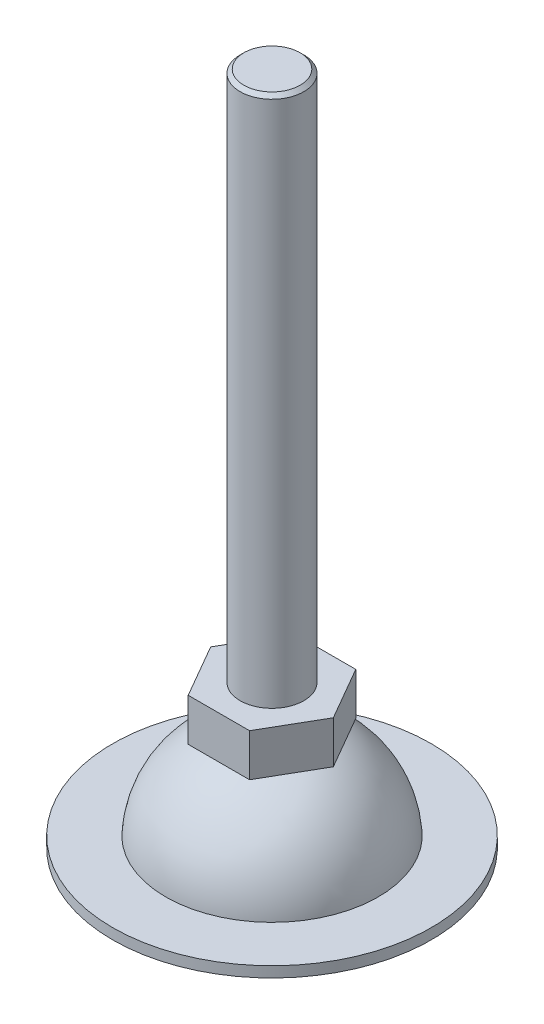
ISO-10303-21;
HEADER;
FILE_DESCRIPTION(('STEP AP214'),'2;1');
FILE_NAME('part.step','',(''),(''),'','','');
FILE_SCHEMA(('AUTOMOTIVE_DESIGN { 1 0 10303 214 1 1 1 1 }'));
ENDSEC;
DATA;
#1=APPLICATION_CONTEXT('core data for automotive mechanical design processes');
#2=APPLICATION_PROTOCOL_DEFINITION('international standard','automotive_design',2000,#1);
#3=PRODUCT_CONTEXT('',#1,'mechanical');
#4=PRODUCT('Part','Part','',(#3));
#5=PRODUCT_RELATED_PRODUCT_CATEGORY('part','',(#4));
#6=PRODUCT_DEFINITION_FORMATION('','',#4);
#7=PRODUCT_DEFINITION_CONTEXT('part definition',#1,'design');
#8=PRODUCT_DEFINITION('design','',#6,#7);
#9=PRODUCT_DEFINITION_SHAPE('','',#8);
#10=(LENGTH_UNIT() NAMED_UNIT(*) SI_UNIT(.MILLI.,.METRE.));
#11=(NAMED_UNIT(*) PLANE_ANGLE_UNIT() SI_UNIT($,.RADIAN.));
#12=(NAMED_UNIT(*) SI_UNIT($,.STERADIAN.) SOLID_ANGLE_UNIT());
#13=UNCERTAINTY_MEASURE_WITH_UNIT(LENGTH_MEASURE(1.E-05),#10,'distance_accuracy_value','');
#14=(GEOMETRIC_REPRESENTATION_CONTEXT(3) GLOBAL_UNCERTAINTY_ASSIGNED_CONTEXT((#13)) GLOBAL_UNIT_ASSIGNED_CONTEXT((#10,
#11,#12)) REPRESENTATION_CONTEXT('',''));
#15=CARTESIAN_POINT('',(0.,0.,0.));
#16=DIRECTION('',(0.,0.,1.));
#17=DIRECTION('',(1.,0.,0.));
#18=AXIS2_PLACEMENT_3D('',#15,#16,#17);
#19=CARTESIAN_POINT('',(0.,127.,1.11022302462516E-13));
#20=DIRECTION('',(0.,1.,0.));
#21=DIRECTION('',(0.,0.,1.));
#22=AXIS2_PLACEMENT_3D('',#19,#20,#21);
#23=CYLINDRICAL_SURFACE('',#22,29.9999999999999);
#24=CARTESIAN_POINT('',(0.,0.,0.));
#25=DIRECTION('',(0.,1.,0.));
#26=DIRECTION('',(0.,0.,1.));
#27=AXIS2_PLACEMENT_3D('',#24,#25,#26);
#28=CIRCLE('',#27,29.9999999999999);
#29=CARTESIAN_POINT('',(0.,0.,29.9999999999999));
#30=VERTEX_POINT('',#29);
#31=EDGE_CURVE('E44',#30,#30,#28,.T.);
#32=ORIENTED_EDGE('',*,*,#31,.T.);
#33=EDGE_LOOP('',(#32));
#34=FACE_BOUND('',#33,.T.);
#35=CARTESIAN_POINT('',(0.,2.00000000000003,0.));
#36=DIRECTION('',(0.,1.,0.));
#37=DIRECTION('',(0.,0.,1.));
#38=AXIS2_PLACEMENT_3D('',#35,#36,#37);
#39=CIRCLE('',#38,29.9999999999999);
#40=CARTESIAN_POINT('',(0.,2.,29.9999999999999));
#41=VERTEX_POINT('',#40);
#42=EDGE_CURVE('E145',#41,#41,#39,.T.);
#43=ORIENTED_EDGE('',*,*,#42,.F.);
#44=EDGE_LOOP('',(#43));
#45=FACE_BOUND('',#44,.T.);
#46=ADVANCED_FACE('F35',(#34,#45),#23,.T.);
#47=CARTESIAN_POINT('',(0.,0.,29.9999999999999));
#48=DIRECTION('',(0.,-1.,0.));
#49=DIRECTION('',(0.,0.,-1.));
#50=AXIS2_PLACEMENT_3D('',#47,#48,#49);
#51=PLANE('',#50);
#52=ORIENTED_EDGE('',*,*,#31,.F.);
#53=EDGE_LOOP('',(#52));
#54=FACE_BOUND('',#53,.T.);
#55=ADVANCED_FACE('F162',(#54),#51,.T.);
#56=CARTESIAN_POINT('',(0.,0.92866239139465,0.));
#57=DIRECTION('',(0.,1.,0.));
#58=DIRECTION('',(0.,0.,1.));
#59=AXIS2_PLACEMENT_3D('',#56,#57,#58);
#60=DEGENERATE_TOROIDAL_SURFACE('',#59,0.896647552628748,19.1333697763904,.T.);
#61=CARTESIAN_POINT('',(0.,19.,0.));
#62=DIRECTION('',(0.,-1.,0.));
#63=DIRECTION('',(0.,0.,-1.));
#64=AXIS2_PLACEMENT_3D('',#61,#62,#63);
#65=CIRCLE('',#64,7.18255210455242);
#66=CARTESIAN_POINT('',(0.,19.,-7.18255210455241));
#67=VERTEX_POINT('',#66);
#68=EDGE_CURVE('E11',#67,#67,#65,.F.);
#69=ORIENTED_EDGE('',*,*,#68,.F.);
#70=EDGE_LOOP('',(#69));
#71=FACE_BOUND('',#70,.T.);
#72=CARTESIAN_POINT('',(0.,2.00000000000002,0.));
#73=DIRECTION('',(0.,1.,0.));
#74=DIRECTION('',(0.,0.,1.));
#75=AXIS2_PLACEMENT_3D('',#72,#73,#74);
#76=CIRCLE('',#75,19.9999999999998);
#77=CARTESIAN_POINT('',(0.,2.,19.9999999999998));
#78=VERTEX_POINT('',#77);
#79=EDGE_CURVE('E148',#78,#78,#76,.T.);
#80=ORIENTED_EDGE('',*,*,#79,.T.);
#81=EDGE_LOOP('',(#80));
#82=FACE_BOUND('',#81,.T.);
#83=ADVANCED_FACE('F164',(#71,#82),#60,.T.);
#84=CARTESIAN_POINT('',(0.,2.,29.9999999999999));
#85=DIRECTION('',(0.,1.,0.));
#86=DIRECTION('',(0.,0.,1.));
#87=AXIS2_PLACEMENT_3D('',#84,#85,#86);
#88=PLANE('',#87);
#89=ORIENTED_EDGE('',*,*,#42,.T.);
#90=EDGE_LOOP('',(#89));
#91=FACE_BOUND('',#90,.T.);
#92=ORIENTED_EDGE('',*,*,#79,.F.);
#93=EDGE_LOOP('',(#92));
#94=FACE_BOUND('',#93,.T.);
#95=ADVANCED_FACE('F169',(#91,#94),#88,.T.);
#96=CARTESIAN_POINT('',(5.77350269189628,27.,-10.0000000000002));
#97=DIRECTION('',(0.866025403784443,0.,-0.499999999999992));
#98=DIRECTION('',(-0.499999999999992,0.,-0.866025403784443));
#99=AXIS2_PLACEMENT_3D('',#96,#97,#98);
#100=PLANE('',#99);
#101=DIRECTION('',(0.499999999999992,0.,0.866025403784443));
#102=VECTOR('',#101,1.);
#103=CARTESIAN_POINT('',(5.77350269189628,19.,-10.0000000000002));
#104=LINE('',#103,#102);
#105=CARTESIAN_POINT('',(5.77350269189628,19.,-10.0000000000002));
#106=VERTEX_POINT('',#105);
#107=CARTESIAN_POINT('',(11.5470053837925,19.,0.));
#108=VERTEX_POINT('',#107);
#109=EDGE_CURVE('E123',#106,#108,#104,.T.);
#110=ORIENTED_EDGE('',*,*,#109,.F.);
#111=DIRECTION('',(0.,-1.,0.));
#112=VECTOR('',#111,1.);
#113=CARTESIAN_POINT('',(5.77350269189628,27.,-10.0000000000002));
#114=LINE('',#113,#112);
#115=CARTESIAN_POINT('',(5.77350269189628,27.,-10.0000000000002));
#116=VERTEX_POINT('',#115);
#117=EDGE_CURVE('E52',#116,#106,#114,.T.);
#118=ORIENTED_EDGE('',*,*,#117,.F.);
#119=DIRECTION('',(0.499999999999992,0.,0.866025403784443));
#120=VECTOR('',#119,1.);
#121=CARTESIAN_POINT('',(5.77350269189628,27.,-10.0000000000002));
#122=LINE('',#121,#120);
#123=CARTESIAN_POINT('',(11.5470053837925,27.,0.));
#124=VERTEX_POINT('',#123);
#125=EDGE_CURVE('E138',#116,#124,#122,.T.);
#126=ORIENTED_EDGE('',*,*,#125,.T.);
#127=DIRECTION('',(0.,-1.,0.));
#128=VECTOR('',#127,1.);
#129=CARTESIAN_POINT('',(11.5470053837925,27.,0.));
#130=LINE('',#129,#128);
#131=EDGE_CURVE('E87',#124,#108,#130,.T.);
#132=ORIENTED_EDGE('',*,*,#131,.T.);
#133=EDGE_LOOP('',(#110,#118,#126,#132));
#134=FACE_BOUND('',#133,.T.);
#135=ADVANCED_FACE('F188',(#134),#100,.T.);
#136=CARTESIAN_POINT('',(5.77350269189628,27.,-10.0000000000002));
#137=DIRECTION('',(0.,0.,-1.));
#138=DIRECTION('',(-1.,0.,0.));
#139=AXIS2_PLACEMENT_3D('',#136,#137,#138);
#140=PLANE('',#139);
#141=DIRECTION('',(1.,0.,0.));
#142=VECTOR('',#141,1.);
#143=CARTESIAN_POINT('',(5.77350269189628,19.,-10.0000000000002));
#144=LINE('',#143,#142);
#145=CARTESIAN_POINT('',(-5.77350269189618,19.,-10.0000000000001));
#146=VERTEX_POINT('',#145);
#147=EDGE_CURVE('E135',#146,#106,#144,.T.);
#148=ORIENTED_EDGE('',*,*,#147,.F.);
#149=DIRECTION('',(0.,-1.,0.));
#150=VECTOR('',#149,1.);
#151=CARTESIAN_POINT('',(-5.77350269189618,27.,-10.0000000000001));
#152=LINE('',#151,#150);
#153=CARTESIAN_POINT('',(-5.77350269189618,27.,-10.0000000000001));
#154=VERTEX_POINT('',#153);
#155=EDGE_CURVE('E75',#154,#146,#152,.T.);
#156=ORIENTED_EDGE('',*,*,#155,.F.);
#157=DIRECTION('',(1.,0.,0.));
#158=VECTOR('',#157,1.);
#159=CARTESIAN_POINT('',(5.77350269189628,27.,-10.0000000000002));
#160=LINE('',#159,#158);
#161=EDGE_CURVE('E113',#154,#116,#160,.T.);
#162=ORIENTED_EDGE('',*,*,#161,.T.);
#163=ORIENTED_EDGE('',*,*,#117,.T.);
#164=EDGE_LOOP('',(#148,#156,#162,#163));
#165=FACE_BOUND('',#164,.T.);
#166=ADVANCED_FACE('F192',(#165),#140,.T.);
#167=CARTESIAN_POINT('',(-5.77350269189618,27.,-10.0000000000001));
#168=DIRECTION('',(-0.866025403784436,0.,-0.500000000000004));
#169=DIRECTION('',(-0.500000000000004,0.,0.866025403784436));
#170=AXIS2_PLACEMENT_3D('',#167,#168,#169);
#171=PLANE('',#170);
#172=DIRECTION('',(0.500000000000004,0.,-0.866025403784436));
#173=VECTOR('',#172,1.);
#174=CARTESIAN_POINT('',(-5.77350269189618,19.,-10.0000000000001));
#175=LINE('',#174,#173);
#176=CARTESIAN_POINT('',(-11.5470053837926,19.,0.));
#177=VERTEX_POINT('',#176);
#178=EDGE_CURVE('E100',#177,#146,#175,.T.);
#179=ORIENTED_EDGE('',*,*,#178,.F.);
#180=DIRECTION('',(0.,-1.,0.));
#181=VECTOR('',#180,1.);
#182=CARTESIAN_POINT('',(-11.5470053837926,27.,0.));
#183=LINE('',#182,#181);
#184=CARTESIAN_POINT('',(-11.5470053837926,27.,0.));
#185=VERTEX_POINT('',#184);
#186=EDGE_CURVE('E95',#185,#177,#183,.T.);
#187=ORIENTED_EDGE('',*,*,#186,.F.);
#188=DIRECTION('',(0.500000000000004,0.,-0.866025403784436));
#189=VECTOR('',#188,1.);
#190=CARTESIAN_POINT('',(-5.77350269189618,27.,-10.0000000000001));
#191=LINE('',#190,#189);
#192=EDGE_CURVE('E98',#185,#154,#191,.T.);
#193=ORIENTED_EDGE('',*,*,#192,.T.);
#194=ORIENTED_EDGE('',*,*,#155,.T.);
#195=EDGE_LOOP('',(#179,#187,#193,#194));
#196=FACE_BOUND('',#195,.T.);
#197=ADVANCED_FACE('F97',(#196),#171,.T.);
#198=CARTESIAN_POINT('',(-11.5470053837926,27.,0.));
#199=DIRECTION('',(-0.866025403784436,0.,0.500000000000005));
#200=DIRECTION('',(0.500000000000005,0.,0.866025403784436));
#201=AXIS2_PLACEMENT_3D('',#198,#199,#200);
#202=PLANE('',#201);
#203=DIRECTION('',(-0.500000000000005,0.,-0.866025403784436));
#204=VECTOR('',#203,1.);
#205=CARTESIAN_POINT('',(-11.5470053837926,19.,0.));
#206=LINE('',#205,#204);
#207=CARTESIAN_POINT('',(-5.77350269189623,19.,10.));
#208=VERTEX_POINT('',#207);
#209=EDGE_CURVE('E132',#208,#177,#206,.T.);
#210=ORIENTED_EDGE('',*,*,#209,.F.);
#211=DIRECTION('',(0.,-1.,0.));
#212=VECTOR('',#211,1.);
#213=CARTESIAN_POINT('',(-5.77350269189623,27.,10.));
#214=LINE('',#213,#212);
#215=CARTESIAN_POINT('',(-5.77350269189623,27.,10.));
#216=VERTEX_POINT('',#215);
#217=EDGE_CURVE('E105',#216,#208,#214,.T.);
#218=ORIENTED_EDGE('',*,*,#217,.F.);
#219=DIRECTION('',(-0.500000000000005,0.,-0.866025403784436));
#220=VECTOR('',#219,1.);
#221=CARTESIAN_POINT('',(-11.5470053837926,27.,0.));
#222=LINE('',#221,#220);
#223=EDGE_CURVE('E111',#216,#185,#222,.T.);
#224=ORIENTED_EDGE('',*,*,#223,.T.);
#225=ORIENTED_EDGE('',*,*,#186,.T.);
#226=EDGE_LOOP('',(#210,#218,#224,#225));
#227=FACE_BOUND('',#226,.T.);
#228=ADVANCED_FACE('F115',(#227),#202,.T.);
#229=CARTESIAN_POINT('',(5.77350269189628,27.,10.));
#230=DIRECTION('',(0.,0.,1.));
#231=DIRECTION('',(0.,-1.,0.));
#232=AXIS2_PLACEMENT_3D('',#229,#230,#231);
#233=PLANE('',#232);
#234=DIRECTION('',(-1.,0.,0.));
#235=VECTOR('',#234,1.);
#236=CARTESIAN_POINT('',(5.77350269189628,19.,10.));
#237=LINE('',#236,#235);
#238=CARTESIAN_POINT('',(5.77350269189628,19.,10.));
#239=VERTEX_POINT('',#238);
#240=EDGE_CURVE('E129',#239,#208,#237,.T.);
#241=ORIENTED_EDGE('',*,*,#240,.F.);
#242=DIRECTION('',(0.,-1.,0.));
#243=VECTOR('',#242,1.);
#244=CARTESIAN_POINT('',(5.77350269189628,27.,10.));
#245=LINE('',#244,#243);
#246=CARTESIAN_POINT('',(5.77350269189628,27.,10.));
#247=VERTEX_POINT('',#246);
#248=EDGE_CURVE('E142',#247,#239,#245,.T.);
#249=ORIENTED_EDGE('',*,*,#248,.F.);
#250=DIRECTION('',(-1.,0.,0.));
#251=VECTOR('',#250,1.);
#252=CARTESIAN_POINT('',(5.77350269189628,27.,10.));
#253=LINE('',#252,#251);
#254=EDGE_CURVE('E116',#247,#216,#253,.T.);
#255=ORIENTED_EDGE('',*,*,#254,.T.);
#256=ORIENTED_EDGE('',*,*,#217,.T.);
#257=EDGE_LOOP('',(#241,#249,#255,#256));
#258=FACE_BOUND('',#257,.T.);
#259=ADVANCED_FACE('F196',(#258),#233,.T.);
#260=CARTESIAN_POINT('',(11.5470053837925,27.,0.));
#261=DIRECTION('',(0.866025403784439,0.,0.499999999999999));
#262=DIRECTION('',(0.499999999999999,0.,-0.866025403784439));
#263=AXIS2_PLACEMENT_3D('',#260,#261,#262);
#264=PLANE('',#263);
#265=DIRECTION('',(-0.499999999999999,0.,0.866025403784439));
#266=VECTOR('',#265,1.);
#267=CARTESIAN_POINT('',(11.5470053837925,19.,0.));
#268=LINE('',#267,#266);
#269=EDGE_CURVE('E126',#108,#239,#268,.T.);
#270=ORIENTED_EDGE('',*,*,#269,.F.);
#271=ORIENTED_EDGE('',*,*,#131,.F.);
#272=DIRECTION('',(-0.499999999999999,0.,0.866025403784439));
#273=VECTOR('',#272,1.);
#274=CARTESIAN_POINT('',(11.5470053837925,27.,0.));
#275=LINE('',#274,#273);
#276=EDGE_CURVE('E118',#124,#247,#275,.T.);
#277=ORIENTED_EDGE('',*,*,#276,.T.);
#278=ORIENTED_EDGE('',*,*,#248,.T.);
#279=EDGE_LOOP('',(#270,#271,#277,#278));
#280=FACE_BOUND('',#279,.T.);
#281=ADVANCED_FACE('F193',(#280),#264,.T.);
#282=CARTESIAN_POINT('',(5.77350269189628,27.,-10.0000000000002));
#283=DIRECTION('',(0.,-1.,0.));
#284=DIRECTION('',(0.,0.,-1.));
#285=AXIS2_PLACEMENT_3D('',#282,#283,#284);
#286=PLANE('',#285);
#287=CARTESIAN_POINT('',(0.,27.,0.));
#288=DIRECTION('',(0.,-1.,0.));
#289=DIRECTION('',(0.,0.,-1.));
#290=AXIS2_PLACEMENT_3D('',#287,#288,#289);
#291=CIRCLE('',#290,6.00000000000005);
#292=CARTESIAN_POINT('',(0.,27.,-6.00000000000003));
#293=VERTEX_POINT('',#292);
#294=EDGE_CURVE('E38',#293,#293,#291,.F.);
#295=ORIENTED_EDGE('',*,*,#294,.F.);
#296=EDGE_LOOP('',(#295));
#297=FACE_BOUND('',#296,.T.);
#298=ORIENTED_EDGE('',*,*,#125,.F.);
#299=ORIENTED_EDGE('',*,*,#161,.F.);
#300=ORIENTED_EDGE('',*,*,#192,.F.);
#301=ORIENTED_EDGE('',*,*,#223,.F.);
#302=ORIENTED_EDGE('',*,*,#254,.F.);
#303=ORIENTED_EDGE('',*,*,#276,.F.);
#304=EDGE_LOOP('',(#298,#299,#300,#301,#302,#303));
#305=FACE_BOUND('',#304,.T.);
#306=ADVANCED_FACE('F109',(#297,#305),#286,.F.);
#307=CARTESIAN_POINT('',(5.77350269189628,19.,-10.0000000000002));
#308=DIRECTION('',(0.,-1.,0.));
#309=DIRECTION('',(0.,0.,-1.));
#310=AXIS2_PLACEMENT_3D('',#307,#308,#309);
#311=PLANE('',#310);
#312=ORIENTED_EDGE('',*,*,#68,.T.);
#313=EDGE_LOOP('',(#312));
#314=FACE_BOUND('',#313,.T.);
#315=ORIENTED_EDGE('',*,*,#109,.T.);
#316=ORIENTED_EDGE('',*,*,#269,.T.);
#317=ORIENTED_EDGE('',*,*,#240,.T.);
#318=ORIENTED_EDGE('',*,*,#209,.T.);
#319=ORIENTED_EDGE('',*,*,#178,.T.);
#320=ORIENTED_EDGE('',*,*,#147,.T.);
#321=EDGE_LOOP('',(#315,#316,#317,#318,#319,#320));
#322=FACE_BOUND('',#321,.T.);
#323=ADVANCED_FACE('F177',(#314,#322),#311,.T.);
#324=CARTESIAN_POINT('',(0.,127.,5.30000000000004));
#325=DIRECTION('',(0.,1.,0.));
#326=DIRECTION('',(0.,0.,1.));
#327=AXIS2_PLACEMENT_3D('',#324,#325,#326);
#328=PLANE('',#327);
#329=CARTESIAN_POINT('',(0.,127.,1.11022302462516E-13));
#330=DIRECTION('',(0.,1.,0.));
#331=DIRECTION('',(0.,0.,1.));
#332=AXIS2_PLACEMENT_3D('',#329,#330,#331);
#333=CIRCLE('',#332,5.29999999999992);
#334=CARTESIAN_POINT('',(0.,127.,5.30000000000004));
#335=VERTEX_POINT('',#334);
#336=EDGE_CURVE('E154',#335,#335,#333,.T.);
#337=ORIENTED_EDGE('',*,*,#336,.T.);
#338=EDGE_LOOP('',(#337));
#339=FACE_BOUND('',#338,.T.);
#340=ADVANCED_FACE('F173',(#339),#328,.T.);
#341=CARTESIAN_POINT('',(0.,127.,1.11022302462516E-13));
#342=DIRECTION('',(0.,-1.,0.));
#343=DIRECTION('',(0.,0.,-1.));
#344=AXIS2_PLACEMENT_3D('',#341,#342,#343);
#345=CONICAL_SURFACE('',#344,5.29999999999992,0.785398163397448);
#346=CARTESIAN_POINT('',(0.,126.3,1.10410368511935E-13));
#347=DIRECTION('',(0.,1.,0.));
#348=DIRECTION('',(0.,0.,1.));
#349=AXIS2_PLACEMENT_3D('',#346,#347,#348);
#350=CIRCLE('',#349,6.00000000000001);
#351=CARTESIAN_POINT('',(0.,126.3,6.00000000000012));
#352=VERTEX_POINT('',#351);
#353=EDGE_CURVE('E151',#352,#352,#350,.T.);
#354=ORIENTED_EDGE('',*,*,#353,.T.);
#355=EDGE_LOOP('',(#354));
#356=FACE_BOUND('',#355,.T.);
#357=ORIENTED_EDGE('',*,*,#336,.F.);
#358=EDGE_LOOP('',(#357));
#359=FACE_BOUND('',#358,.T.);
#360=ADVANCED_FACE('F176',(#356,#359),#345,.T.);
#361=CARTESIAN_POINT('',(0.,127.,1.11022302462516E-13));
#362=DIRECTION('',(0.,1.,0.));
#363=DIRECTION('',(0.,0.,1.));
#364=AXIS2_PLACEMENT_3D('',#361,#362,#363);
#365=CYLINDRICAL_SURFACE('',#364,6.00000000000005);
#366=ORIENTED_EDGE('',*,*,#353,.F.);
#367=EDGE_LOOP('',(#366));
#368=FACE_BOUND('',#367,.T.);
#369=ORIENTED_EDGE('',*,*,#294,.T.);
#370=EDGE_LOOP('',(#369));
#371=FACE_BOUND('',#370,.T.);
#372=ADVANCED_FACE('F181',(#368,#371),#365,.T.);
#373=CLOSED_SHELL('',(#46,#55,#83,#95,#135,#166,#197,#228,#259,#281,#306,#323,#340,#360,#372));
#374=MANIFOLD_SOLID_BREP('B2',#373);
#375=ADVANCED_BREP_SHAPE_REPRESENTATION('',(#18,#374),#14);
#376=SHAPE_DEFINITION_REPRESENTATION(#9,#375);
ENDSEC;
END-ISO-10303-21;
